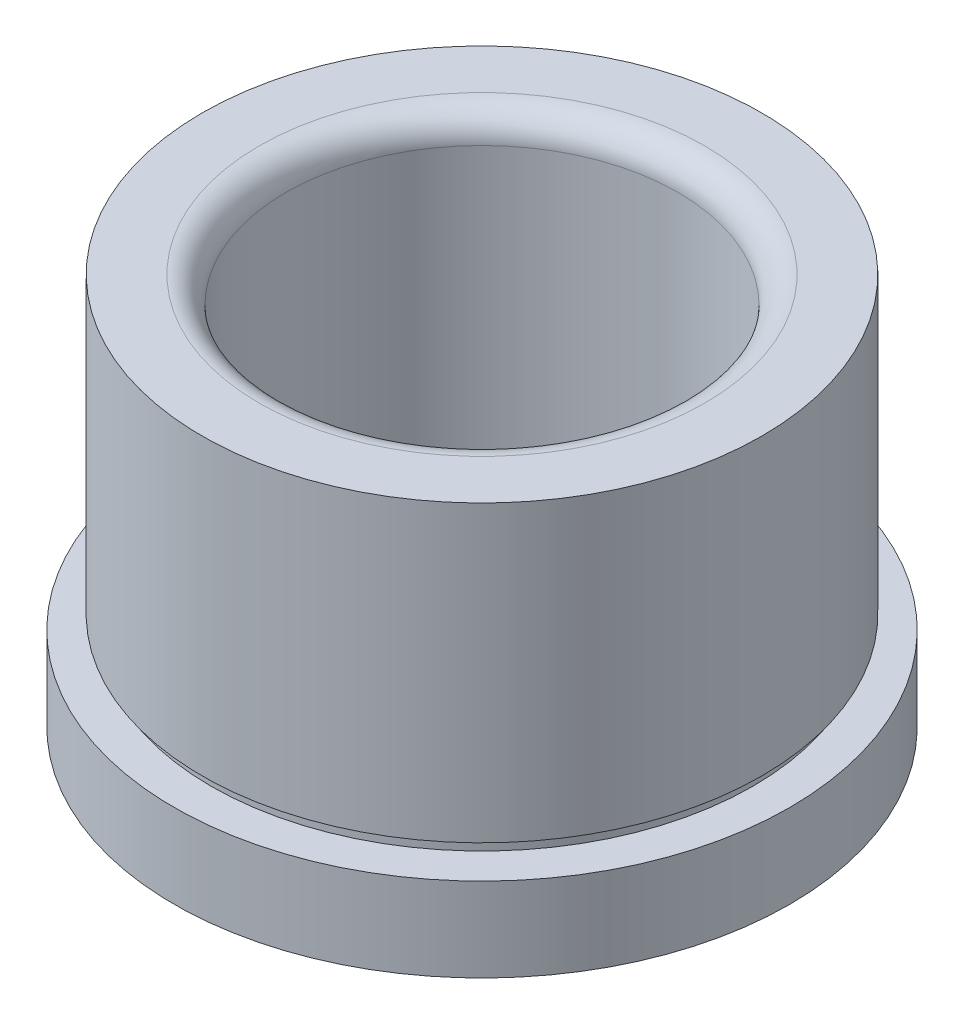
from build123d import *

# Parameters (mm, degrees)
FILLET1_R = 1.524


with BuildPart() as part:
    # Sketch1 → Revolve1 (revolve)
    with BuildSketch(Plane.XY, mode=Mode.PRIVATE) as revolve1_sk:
        Polygon((-11.11885, 38.150690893), (-11.11885, 16.741746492), (-11.934905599, 15.925690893), (-17.4625, 15.925690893), (-17.4625, 20.688190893), (-15.37335, 20.688190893), (-15.37335, 21.450190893), (-15.88135, 21.450190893), (-15.88135, 38.150690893), align=None)
    revolve(revolve1_sk.sketch.rotate(Axis((0, -1000, 0), (0, 1, 0)), 180), axis=Axis((0, -1000, 0), (0, 1, 0)))

    # Fillet1
    fillet1_edges = [part.edges().sort_by_distance(p)[0] for p in [
        (-11.11885, 38.150690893, 0),
    ]]
    fillet(fillet1_edges, radius=FILLET1_R)


solid = part.part
